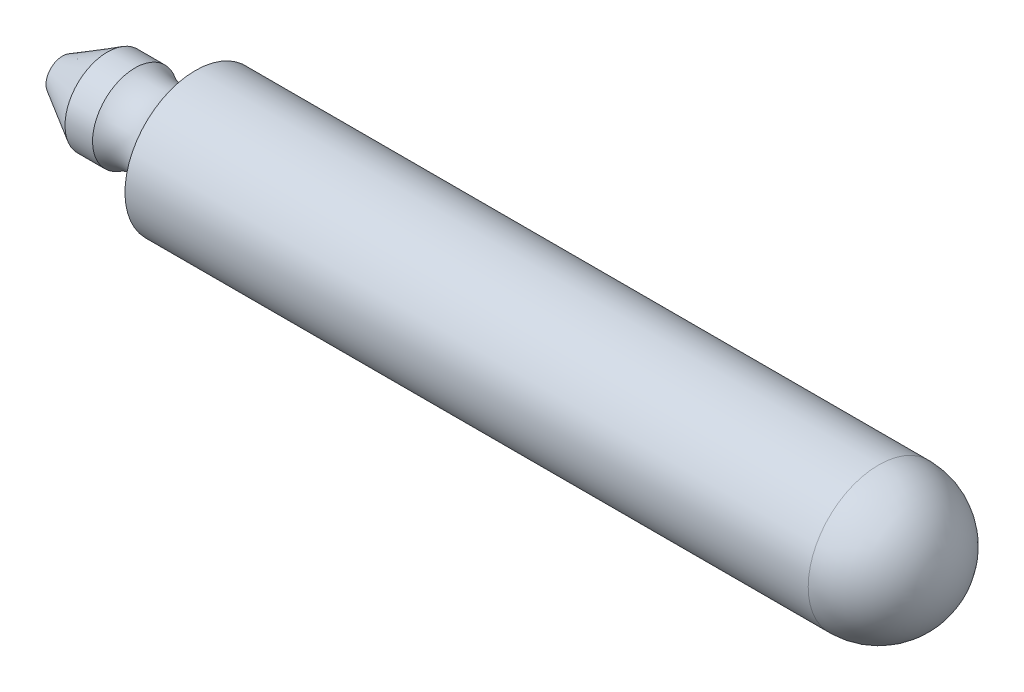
ISO-10303-21;
HEADER;
FILE_DESCRIPTION(('STEP AP214'),'2;1');
FILE_NAME('part.step','',(''),(''),'','','');
FILE_SCHEMA(('AUTOMOTIVE_DESIGN { 1 0 10303 214 1 1 1 1 }'));
ENDSEC;
DATA;
#1=APPLICATION_CONTEXT('core data for automotive mechanical design processes');
#2=APPLICATION_PROTOCOL_DEFINITION('international standard','automotive_design',2000,#1);
#3=PRODUCT_CONTEXT('',#1,'mechanical');
#4=PRODUCT('Part','Part','',(#3));
#5=PRODUCT_RELATED_PRODUCT_CATEGORY('part','',(#4));
#6=PRODUCT_DEFINITION_FORMATION('','',#4);
#7=PRODUCT_DEFINITION_CONTEXT('part definition',#1,'design');
#8=PRODUCT_DEFINITION('design','',#6,#7);
#9=PRODUCT_DEFINITION_SHAPE('','',#8);
#10=(LENGTH_UNIT() NAMED_UNIT(*) SI_UNIT(.MILLI.,.METRE.));
#11=(NAMED_UNIT(*) PLANE_ANGLE_UNIT() SI_UNIT($,.RADIAN.));
#12=(NAMED_UNIT(*) SI_UNIT($,.STERADIAN.) SOLID_ANGLE_UNIT());
#13=UNCERTAINTY_MEASURE_WITH_UNIT(LENGTH_MEASURE(1.E-05),#10,'distance_accuracy_value','');
#14=(GEOMETRIC_REPRESENTATION_CONTEXT(3) GLOBAL_UNCERTAINTY_ASSIGNED_CONTEXT((#13)) GLOBAL_UNIT_ASSIGNED_CONTEXT((#10,
#11,#12)) REPRESENTATION_CONTEXT('',''));
#15=CARTESIAN_POINT('',(0.,0.,0.));
#16=DIRECTION('',(0.,0.,1.));
#17=DIRECTION('',(1.,0.,0.));
#18=AXIS2_PLACEMENT_3D('',#15,#16,#17);
#19=CARTESIAN_POINT('',(-15.748,0.,0.));
#20=DIRECTION('',(-1.,0.,0.));
#21=DIRECTION('',(0.,-1.,0.));
#22=AXIS2_PLACEMENT_3D('',#19,#20,#21);
#23=PLANE('',#22);
#24=CARTESIAN_POINT('',(-15.748,0.,0.));
#25=DIRECTION('',(1.,0.,0.));
#26=DIRECTION('',(0.,1.,0.));
#27=AXIS2_PLACEMENT_3D('',#24,#25,#26);
#28=CIRCLE('',#27,0.318);
#29=CARTESIAN_POINT('',(-15.748,0.317999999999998,0.));
#30=VERTEX_POINT('',#29);
#31=EDGE_CURVE('E48',#30,#30,#28,.T.);
#32=ORIENTED_EDGE('',*,*,#31,.F.);
#33=EDGE_LOOP('',(#32));
#34=FACE_BOUND('',#33,.T.);
#35=ADVANCED_FACE('F29',(#34),#23,.T.);
#36=CARTESIAN_POINT('',(0.,0.,0.));
#37=DIRECTION('',(1.,0.,0.));
#38=DIRECTION('',(0.,-1.,0.));
#39=AXIS2_PLACEMENT_3D('',#36,#37,#38);
#40=SPHERICAL_SURFACE('',#39,1.359);
#41=CARTESIAN_POINT('',(0.,0.,0.));
#42=DIRECTION('',(1.,0.,0.));
#43=DIRECTION('',(0.,1.,0.));
#44=AXIS2_PLACEMENT_3D('',#41,#42,#43);
#45=CIRCLE('',#44,1.359);
#46=CARTESIAN_POINT('',(0.,1.359,0.));
#47=VERTEX_POINT('',#46);
#48=EDGE_CURVE('E10',#47,#47,#45,.T.);
#49=ORIENTED_EDGE('',*,*,#48,.T.);
#50=EDGE_LOOP('',(#49));
#51=FACE_BOUND('',#50,.T.);
#52=ADVANCED_FACE('F56',(#51),#40,.T.);
#53=CARTESIAN_POINT('',(0.,0.,0.));
#54=DIRECTION('',(1.,0.,0.));
#55=DIRECTION('',(0.,1.,0.));
#56=AXIS2_PLACEMENT_3D('',#53,#54,#55);
#57=CYLINDRICAL_SURFACE('',#56,1.359);
#58=CARTESIAN_POINT('',(-13.183,0.,0.));
#59=DIRECTION('',(1.,0.,0.));
#60=DIRECTION('',(0.,1.,0.));
#61=AXIS2_PLACEMENT_3D('',#58,#59,#60);
#62=CIRCLE('',#61,1.359);
#63=CARTESIAN_POINT('',(-13.183,1.359,0.));
#64=VERTEX_POINT('',#63);
#65=EDGE_CURVE('E35',#64,#64,#62,.T.);
#66=ORIENTED_EDGE('',*,*,#65,.T.);
#67=EDGE_LOOP('',(#66));
#68=FACE_BOUND('',#67,.T.);
#69=ORIENTED_EDGE('',*,*,#48,.F.);
#70=EDGE_LOOP('',(#69));
#71=FACE_BOUND('',#70,.T.);
#72=ADVANCED_FACE('F60',(#68,#71),#57,.T.);
#73=CARTESIAN_POINT('',(-13.9381423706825,0.,0.));
#74=DIRECTION('',(1.,0.,0.));
#75=DIRECTION('',(0.,1.,0.));
#76=AXIS2_PLACEMENT_3D('',#73,#74,#75);
#77=TOROIDAL_SURFACE('',#76,1.461,0.762000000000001);
#78=CARTESIAN_POINT('',(-14.3486055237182,0.,0.));
#79=DIRECTION('',(1.,0.,0.));
#80=DIRECTION('',(0.,1.,0.));
#81=AXIS2_PLACEMENT_3D('',#78,#79,#80);
#82=CIRCLE('',#81,0.819000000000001);
#83=CARTESIAN_POINT('',(-14.3486055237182,0.818999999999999,0.));
#84=VERTEX_POINT('',#83);
#85=EDGE_CURVE('E39',#84,#84,#82,.T.);
#86=ORIENTED_EDGE('',*,*,#85,.T.);
#87=EDGE_LOOP('',(#86));
#88=FACE_BOUND('',#87,.T.);
#89=ORIENTED_EDGE('',*,*,#65,.F.);
#90=EDGE_LOOP('',(#89));
#91=FACE_BOUND('',#90,.T.);
#92=ADVANCED_FACE('F64',(#88,#91),#77,.F.);
#93=CARTESIAN_POINT('',(0.,0.,0.));
#94=DIRECTION('',(1.,0.,0.));
#95=DIRECTION('',(0.,1.,0.));
#96=AXIS2_PLACEMENT_3D('',#93,#94,#95);
#97=CYLINDRICAL_SURFACE('',#96,0.819);
#98=CARTESIAN_POINT('',(-14.880242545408,0.,0.));
#99=DIRECTION('',(1.,0.,0.));
#100=DIRECTION('',(0.,1.,0.));
#101=AXIS2_PLACEMENT_3D('',#98,#99,#100);
#102=CIRCLE('',#101,0.819);
#103=CARTESIAN_POINT('',(-14.880242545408,0.818999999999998,0.));
#104=VERTEX_POINT('',#103);
#105=EDGE_CURVE('E43',#104,#104,#102,.T.);
#106=ORIENTED_EDGE('',*,*,#105,.T.);
#107=EDGE_LOOP('',(#106));
#108=FACE_BOUND('',#107,.T.);
#109=ORIENTED_EDGE('',*,*,#85,.F.);
#110=EDGE_LOOP('',(#109));
#111=FACE_BOUND('',#110,.T.);
#112=ADVANCED_FACE('F69',(#108,#111),#97,.T.);
#113=CARTESIAN_POINT('',(-14.880242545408,0.,0.));
#114=DIRECTION('',(1.,0.,0.));
#115=DIRECTION('',(0.,1.,0.));
#116=AXIS2_PLACEMENT_3D('',#113,#114,#115);
#117=CONICAL_SURFACE('',#116,0.819,0.523598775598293);
#118=ORIENTED_EDGE('',*,*,#31,.T.);
#119=EDGE_LOOP('',(#118));
#120=FACE_BOUND('',#119,.T.);
#121=ORIENTED_EDGE('',*,*,#105,.F.);
#122=EDGE_LOOP('',(#121));
#123=FACE_BOUND('',#122,.T.);
#124=ADVANCED_FACE('F52',(#120,#123),#117,.T.);
#125=CLOSED_SHELL('',(#35,#52,#72,#92,#112,#124));
#126=MANIFOLD_SOLID_BREP('B2',#125);
#127=ADVANCED_BREP_SHAPE_REPRESENTATION('',(#18,#126),#14);
#128=SHAPE_DEFINITION_REPRESENTATION(#9,#127);
ENDSEC;
END-ISO-10303-21;
